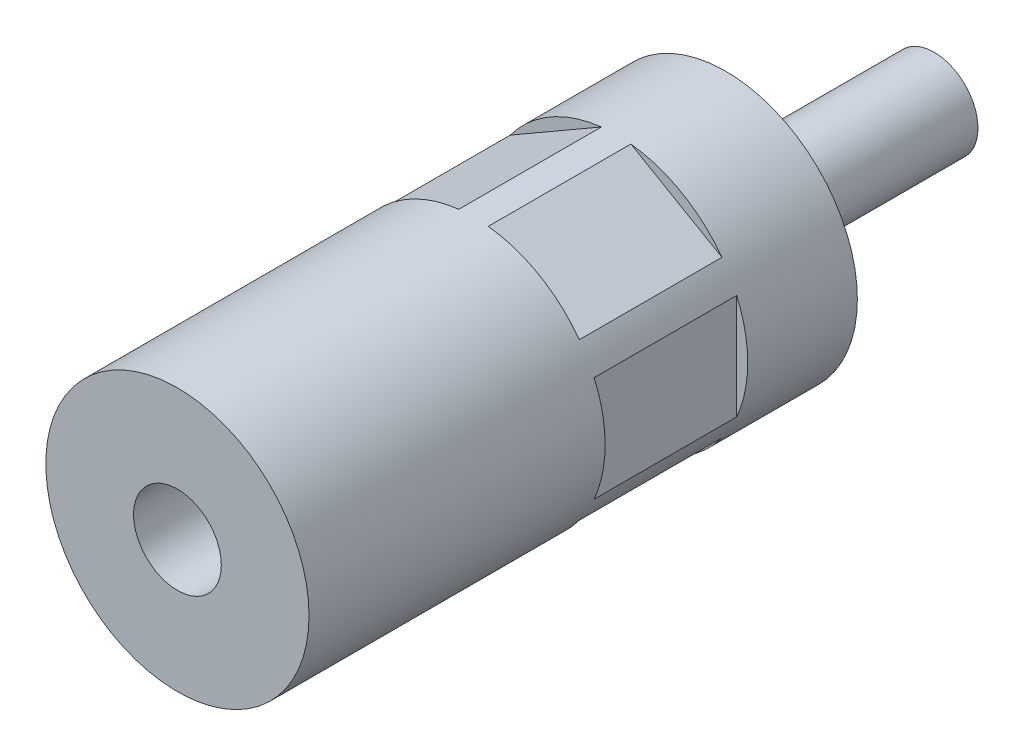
ISO-10303-21;
HEADER;
FILE_DESCRIPTION(('STEP AP214'),'2;1');
FILE_NAME('part.step','',(''),(''),'','','');
FILE_SCHEMA(('AUTOMOTIVE_DESIGN { 1 0 10303 214 1 1 1 1 }'));
ENDSEC;
DATA;
#1=APPLICATION_CONTEXT('core data for automotive mechanical design processes');
#2=APPLICATION_PROTOCOL_DEFINITION('international standard','automotive_design',2000,#1);
#3=PRODUCT_CONTEXT('',#1,'mechanical');
#4=PRODUCT('Part','Part','',(#3));
#5=PRODUCT_RELATED_PRODUCT_CATEGORY('part','',(#4));
#6=PRODUCT_DEFINITION_FORMATION('','',#4);
#7=PRODUCT_DEFINITION_CONTEXT('part definition',#1,'design');
#8=PRODUCT_DEFINITION('design','',#6,#7);
#9=PRODUCT_DEFINITION_SHAPE('','',#8);
#10=(LENGTH_UNIT() NAMED_UNIT(*) SI_UNIT(.MILLI.,.METRE.));
#11=(NAMED_UNIT(*) PLANE_ANGLE_UNIT() SI_UNIT($,.RADIAN.));
#12=(NAMED_UNIT(*) SI_UNIT($,.STERADIAN.) SOLID_ANGLE_UNIT());
#13=UNCERTAINTY_MEASURE_WITH_UNIT(LENGTH_MEASURE(1.E-05),#10,'distance_accuracy_value','');
#14=(GEOMETRIC_REPRESENTATION_CONTEXT(3) GLOBAL_UNCERTAINTY_ASSIGNED_CONTEXT((#13)) GLOBAL_UNIT_ASSIGNED_CONTEXT((#10,
#11,#12)) REPRESENTATION_CONTEXT('',''));
#15=CARTESIAN_POINT('',(0.,0.,0.));
#16=DIRECTION('',(0.,0.,1.));
#17=DIRECTION('',(1.,0.,0.));
#18=AXIS2_PLACEMENT_3D('',#15,#16,#17);
#19=CARTESIAN_POINT('',(0.,0.,80.));
#20=DIRECTION('',(0.,0.,1.));
#21=DIRECTION('',(1.,0.,0.));
#22=AXIS2_PLACEMENT_3D('',#19,#20,#21);
#23=CYLINDRICAL_SURFACE('',#22,12.);
#24=CARTESIAN_POINT('',(0.,0.,10.));
#25=DIRECTION('',(0.,0.,1.));
#26=DIRECTION('',(1.,0.,0.));
#27=AXIS2_PLACEMENT_3D('',#24,#25,#26);
#28=CIRCLE('',#27,12.);
#29=CARTESIAN_POINT('',(-9.653311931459,-7.12836367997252,10.));
#30=VERTEX_POINT('',#29);
#31=CARTESIAN_POINT('',(-1.34668806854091,-11.9241952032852,10.));
#32=VERTEX_POINT('',#31);
#33=EDGE_CURVE('E152',#30,#32,#28,.T.);
#34=ORIENTED_EDGE('',*,*,#33,.F.);
#35=DIRECTION('',(0.,0.,1.));
#36=VECTOR('',#35,1.);
#37=CARTESIAN_POINT('',(-9.65331193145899,-7.12836367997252,80.));
#38=LINE('',#37,#36);
#39=CARTESIAN_POINT('',(-9.653311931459,-7.12836367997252,23.));
#40=VERTEX_POINT('',#39);
#41=EDGE_CURVE('E9',#30,#40,#38,.T.);
#42=ORIENTED_EDGE('',*,*,#41,.T.);
#43=CARTESIAN_POINT('',(0.,0.,23.));
#44=DIRECTION('',(0.,0.,1.));
#45=DIRECTION('',(1.,0.,0.));
#46=AXIS2_PLACEMENT_3D('',#43,#44,#45);
#47=CIRCLE('',#46,12.);
#48=CARTESIAN_POINT('',(-1.34668806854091,-11.9241952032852,23.));
#49=VERTEX_POINT('',#48);
#50=EDGE_CURVE('E22',#40,#49,#47,.T.);
#51=ORIENTED_EDGE('',*,*,#50,.T.);
#52=DIRECTION('',(0.,0.,1.));
#53=VECTOR('',#52,1.);
#54=CARTESIAN_POINT('',(-1.34668806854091,-11.9241952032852,80.));
#55=LINE('',#54,#53);
#56=EDGE_CURVE('E149',#49,#32,#55,.F.);
#57=ORIENTED_EDGE('',*,*,#56,.T.);
#58=EDGE_LOOP('',(#34,#42,#51,#57));
#59=FACE_BOUND('',#58,.T.);
#60=DIRECTION('',(0.,0.,1.));
#61=VECTOR('',#60,1.);
#62=CARTESIAN_POINT('',(11.,4.79583152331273,80.));
#63=LINE('',#62,#61);
#64=CARTESIAN_POINT('',(11.,4.79583152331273,10.));
#65=VERTEX_POINT('',#64);
#66=CARTESIAN_POINT('',(11.,4.79583152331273,23.));
#67=VERTEX_POINT('',#66);
#68=EDGE_CURVE('E142',#65,#67,#63,.T.);
#69=ORIENTED_EDGE('',*,*,#68,.F.);
#70=CARTESIAN_POINT('',(11.,-4.79583152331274,10.));
#71=VERTEX_POINT('',#70);
#72=EDGE_CURVE('E141',#71,#65,#28,.T.);
#73=ORIENTED_EDGE('',*,*,#72,.F.);
#74=DIRECTION('',(0.,0.,1.));
#75=VECTOR('',#74,1.);
#76=CARTESIAN_POINT('',(11.,-4.79583152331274,80.));
#77=LINE('',#76,#75);
#78=CARTESIAN_POINT('',(11.,-4.79583152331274,23.));
#79=VERTEX_POINT('',#78);
#80=EDGE_CURVE('E138',#79,#71,#77,.F.);
#81=ORIENTED_EDGE('',*,*,#80,.F.);
#82=EDGE_CURVE('E145',#79,#67,#47,.T.);
#83=ORIENTED_EDGE('',*,*,#82,.T.);
#84=EDGE_LOOP('',(#69,#73,#81,#83));
#85=FACE_BOUND('',#84,.T.);
#86=CARTESIAN_POINT('',(9.65331193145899,7.12836367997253,10.));
#87=VERTEX_POINT('',#86);
#88=CARTESIAN_POINT('',(1.34668806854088,11.9241952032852,10.));
#89=VERTEX_POINT('',#88);
#90=EDGE_CURVE('E134',#87,#89,#28,.T.);
#91=ORIENTED_EDGE('',*,*,#90,.F.);
#92=DIRECTION('',(0.,0.,1.));
#93=VECTOR('',#92,1.);
#94=CARTESIAN_POINT('',(9.65331193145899,7.12836367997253,80.));
#95=LINE('',#94,#93);
#96=CARTESIAN_POINT('',(9.65331193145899,7.12836367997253,23.));
#97=VERTEX_POINT('',#96);
#98=EDGE_CURVE('E135',#87,#97,#95,.T.);
#99=ORIENTED_EDGE('',*,*,#98,.T.);
#100=CARTESIAN_POINT('',(1.34668806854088,11.9241952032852,23.));
#101=VERTEX_POINT('',#100);
#102=EDGE_CURVE('E139',#97,#101,#47,.T.);
#103=ORIENTED_EDGE('',*,*,#102,.T.);
#104=DIRECTION('',(0.,0.,1.));
#105=VECTOR('',#104,1.);
#106=CARTESIAN_POINT('',(1.34668806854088,11.9241952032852,80.));
#107=LINE('',#106,#105);
#108=EDGE_CURVE('E131',#101,#89,#107,.F.);
#109=ORIENTED_EDGE('',*,*,#108,.T.);
#110=EDGE_LOOP('',(#91,#99,#103,#109));
#111=FACE_BOUND('',#110,.T.);
#112=CARTESIAN_POINT('',(0.,0.,0.));
#113=DIRECTION('',(0.,0.,1.));
#114=DIRECTION('',(1.,0.,0.));
#115=AXIS2_PLACEMENT_3D('',#112,#113,#114);
#116=CIRCLE('',#115,12.);
#117=CARTESIAN_POINT('',(12.,0.,0.));
#118=VERTEX_POINT('',#117);
#119=EDGE_CURVE('E204',#118,#118,#116,.T.);
#120=ORIENTED_EDGE('',*,*,#119,.T.);
#121=EDGE_LOOP('',(#120));
#122=FACE_BOUND('',#121,.T.);
#123=CARTESIAN_POINT('',(0.,0.,50.));
#124=DIRECTION('',(0.,0.,1.));
#125=DIRECTION('',(1.,0.,0.));
#126=AXIS2_PLACEMENT_3D('',#123,#124,#125);
#127=CIRCLE('',#126,12.);
#128=CARTESIAN_POINT('',(12.,0.,50.));
#129=VERTEX_POINT('',#128);
#130=EDGE_CURVE('E201',#129,#129,#127,.T.);
#131=ORIENTED_EDGE('',*,*,#130,.F.);
#132=EDGE_LOOP('',(#131));
#133=FACE_BOUND('',#132,.T.);
#134=CARTESIAN_POINT('',(-11.,4.79583152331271,10.));
#135=VERTEX_POINT('',#134);
#136=CARTESIAN_POINT('',(-11.,-4.79583152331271,10.));
#137=VERTEX_POINT('',#136);
#138=EDGE_CURVE('E111',#135,#137,#28,.T.);
#139=ORIENTED_EDGE('',*,*,#138,.F.);
#140=DIRECTION('',(0.,0.,1.));
#141=VECTOR('',#140,1.);
#142=CARTESIAN_POINT('',(-11.,4.79583152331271,80.));
#143=LINE('',#142,#141);
#144=CARTESIAN_POINT('',(-11.,4.79583152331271,23.));
#145=VERTEX_POINT('',#144);
#146=EDGE_CURVE('E110',#135,#145,#143,.T.);
#147=ORIENTED_EDGE('',*,*,#146,.T.);
#148=CARTESIAN_POINT('',(-11.,-4.79583152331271,23.));
#149=VERTEX_POINT('',#148);
#150=EDGE_CURVE('E103',#145,#149,#47,.T.);
#151=ORIENTED_EDGE('',*,*,#150,.T.);
#152=DIRECTION('',(0.,0.,1.));
#153=VECTOR('',#152,1.);
#154=CARTESIAN_POINT('',(-11.,-4.79583152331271,80.));
#155=LINE('',#154,#153);
#156=EDGE_CURVE('E117',#149,#137,#155,.F.);
#157=ORIENTED_EDGE('',*,*,#156,.T.);
#158=EDGE_LOOP('',(#139,#147,#151,#157));
#159=FACE_BOUND('',#158,.T.);
#160=DIRECTION('',(0.,0.,1.));
#161=VECTOR('',#160,1.);
#162=CARTESIAN_POINT('',(-9.65331193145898,7.12836367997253,80.));
#163=LINE('',#162,#161);
#164=CARTESIAN_POINT('',(-9.65331193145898,7.12836367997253,10.));
#165=VERTEX_POINT('',#164);
#166=CARTESIAN_POINT('',(-9.65331193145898,7.12836367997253,23.));
#167=VERTEX_POINT('',#166);
#168=EDGE_CURVE('E129',#165,#167,#163,.T.);
#169=ORIENTED_EDGE('',*,*,#168,.F.);
#170=CARTESIAN_POINT('',(-1.3466880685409,11.9241952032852,10.));
#171=VERTEX_POINT('',#170);
#172=EDGE_CURVE('E125',#171,#165,#28,.T.);
#173=ORIENTED_EDGE('',*,*,#172,.F.);
#174=DIRECTION('',(0.,0.,1.));
#175=VECTOR('',#174,1.);
#176=CARTESIAN_POINT('',(-1.3466880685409,11.9241952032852,80.));
#177=LINE('',#176,#175);
#178=CARTESIAN_POINT('',(-1.3466880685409,11.9241952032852,23.));
#179=VERTEX_POINT('',#178);
#180=EDGE_CURVE('E123',#179,#171,#177,.F.);
#181=ORIENTED_EDGE('',*,*,#180,.F.);
#182=EDGE_CURVE('E113',#179,#167,#47,.T.);
#183=ORIENTED_EDGE('',*,*,#182,.T.);
#184=EDGE_LOOP('',(#169,#173,#181,#183));
#185=FACE_BOUND('',#184,.T.);
#186=DIRECTION('',(0.,0.,1.));
#187=VECTOR('',#186,1.);
#188=CARTESIAN_POINT('',(9.65331193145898,-7.12836367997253,80.));
#189=LINE('',#188,#187);
#190=CARTESIAN_POINT('',(9.65331193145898,-7.12836367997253,10.));
#191=VERTEX_POINT('',#190);
#192=CARTESIAN_POINT('',(9.65331193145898,-7.12836367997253,23.));
#193=VERTEX_POINT('',#192);
#194=EDGE_CURVE('E148',#191,#193,#189,.T.);
#195=ORIENTED_EDGE('',*,*,#194,.F.);
#196=CARTESIAN_POINT('',(1.34668806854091,-11.9241952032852,10.));
#197=VERTEX_POINT('',#196);
#198=EDGE_CURVE('E147',#197,#191,#28,.T.);
#199=ORIENTED_EDGE('',*,*,#198,.F.);
#200=DIRECTION('',(0.,0.,1.));
#201=VECTOR('',#200,1.);
#202=CARTESIAN_POINT('',(1.34668806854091,-11.9241952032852,80.));
#203=LINE('',#202,#201);
#204=CARTESIAN_POINT('',(1.34668806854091,-11.9241952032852,23.));
#205=VERTEX_POINT('',#204);
#206=EDGE_CURVE('E144',#205,#197,#203,.F.);
#207=ORIENTED_EDGE('',*,*,#206,.F.);
#208=EDGE_CURVE('E150',#205,#193,#47,.T.);
#209=ORIENTED_EDGE('',*,*,#208,.T.);
#210=EDGE_LOOP('',(#195,#199,#207,#209));
#211=FACE_BOUND('',#210,.T.);
#212=ADVANCED_FACE('F14',(#59,#85,#111,#122,#133,#159,#185,#211),#23,.T.);
#213=CARTESIAN_POINT('',(0.,0.,-19.));
#214=DIRECTION('',(0.,0.,1.));
#215=DIRECTION('',(1.,0.,0.));
#216=AXIS2_PLACEMENT_3D('',#213,#214,#215);
#217=PLANE('',#216);
#218=CARTESIAN_POINT('',(0.,0.,-19.));
#219=DIRECTION('',(0.,0.,1.));
#220=DIRECTION('',(1.,0.,0.));
#221=AXIS2_PLACEMENT_3D('',#218,#219,#220);
#222=CIRCLE('',#221,4.);
#223=CARTESIAN_POINT('',(4.,0.,-19.));
#224=VERTEX_POINT('',#223);
#225=EDGE_CURVE('E159',#224,#224,#222,.T.);
#226=ORIENTED_EDGE('',*,*,#225,.F.);
#227=EDGE_LOOP('',(#226));
#228=FACE_BOUND('',#227,.T.);
#229=ADVANCED_FACE('F16',(#228),#217,.F.);
#230=CARTESIAN_POINT('',(0.,0.,80.));
#231=DIRECTION('',(0.,0.,1.));
#232=DIRECTION('',(1.,0.,0.));
#233=AXIS2_PLACEMENT_3D('',#230,#231,#232);
#234=CYLINDRICAL_SURFACE('',#233,4.);
#235=CARTESIAN_POINT('',(0.,0.,-2.5));
#236=DIRECTION('',(0.,0.,1.));
#237=DIRECTION('',(1.,0.,0.));
#238=AXIS2_PLACEMENT_3D('',#235,#236,#237);
#239=CIRCLE('',#238,4.);
#240=CARTESIAN_POINT('',(4.,0.,-2.5));
#241=VERTEX_POINT('',#240);
#242=EDGE_CURVE('E213',#241,#241,#239,.T.);
#243=ORIENTED_EDGE('',*,*,#242,.F.);
#244=EDGE_LOOP('',(#243));
#245=FACE_BOUND('',#244,.T.);
#246=ORIENTED_EDGE('',*,*,#225,.T.);
#247=EDGE_LOOP('',(#246));
#248=FACE_BOUND('',#247,.T.);
#249=ADVANCED_FACE('F219',(#245,#248),#234,.T.);
#250=CARTESIAN_POINT('',(3.25,0.,-2.5));
#251=DIRECTION('',(0.,0.,1.));
#252=DIRECTION('',(1.,0.,0.));
#253=AXIS2_PLACEMENT_3D('',#250,#251,#252);
#254=PLANE('',#253);
#255=ORIENTED_EDGE('',*,*,#242,.T.);
#256=EDGE_LOOP('',(#255));
#257=FACE_BOUND('',#256,.T.);
#258=CARTESIAN_POINT('',(0.,0.,-2.5));
#259=DIRECTION('',(0.,0.,1.));
#260=DIRECTION('',(1.,0.,0.));
#261=AXIS2_PLACEMENT_3D('',#258,#259,#260);
#262=CIRCLE('',#261,3.25);
#263=CARTESIAN_POINT('',(3.25,0.,-2.5));
#264=VERTEX_POINT('',#263);
#265=EDGE_CURVE('E210',#264,#264,#262,.T.);
#266=ORIENTED_EDGE('',*,*,#265,.F.);
#267=EDGE_LOOP('',(#266));
#268=FACE_BOUND('',#267,.T.);
#269=ADVANCED_FACE('F228',(#257,#268),#254,.T.);
#270=CARTESIAN_POINT('',(0.,0.,80.));
#271=DIRECTION('',(0.,0.,1.));
#272=DIRECTION('',(1.,0.,0.));
#273=AXIS2_PLACEMENT_3D('',#270,#271,#272);
#274=CYLINDRICAL_SURFACE('',#273,3.25);
#275=ORIENTED_EDGE('',*,*,#265,.T.);
#276=EDGE_LOOP('',(#275));
#277=FACE_BOUND('',#276,.T.);
#278=CARTESIAN_POINT('',(0.,0.,0.));
#279=DIRECTION('',(0.,0.,1.));
#280=DIRECTION('',(1.,0.,0.));
#281=AXIS2_PLACEMENT_3D('',#278,#279,#280);
#282=CIRCLE('',#281,3.25);
#283=CARTESIAN_POINT('',(3.25,0.,0.));
#284=VERTEX_POINT('',#283);
#285=EDGE_CURVE('E207',#284,#284,#282,.T.);
#286=ORIENTED_EDGE('',*,*,#285,.F.);
#287=EDGE_LOOP('',(#286));
#288=FACE_BOUND('',#287,.T.);
#289=ADVANCED_FACE('F241',(#277,#288),#274,.T.);
#290=CARTESIAN_POINT('',(12.,0.,0.));
#291=DIRECTION('',(0.,0.,-1.));
#292=DIRECTION('',(-1.,0.,0.));
#293=AXIS2_PLACEMENT_3D('',#290,#291,#292);
#294=PLANE('',#293);
#295=ORIENTED_EDGE('',*,*,#285,.T.);
#296=EDGE_LOOP('',(#295));
#297=FACE_BOUND('',#296,.T.);
#298=ORIENTED_EDGE('',*,*,#119,.F.);
#299=EDGE_LOOP('',(#298));
#300=FACE_BOUND('',#299,.T.);
#301=ADVANCED_FACE('F238',(#297,#300),#294,.T.);
#302=CARTESIAN_POINT('',(12.,0.,50.));
#303=DIRECTION('',(0.,0.,-1.));
#304=DIRECTION('',(-1.,0.,0.));
#305=AXIS2_PLACEMENT_3D('',#302,#303,#304);
#306=PLANE('',#305);
#307=CARTESIAN_POINT('',(0.,0.,50.));
#308=DIRECTION('',(0.,0.,1.));
#309=DIRECTION('',(1.,0.,0.));
#310=AXIS2_PLACEMENT_3D('',#307,#308,#309);
#311=CIRCLE('',#310,4.);
#312=CARTESIAN_POINT('',(4.,0.,50.));
#313=VERTEX_POINT('',#312);
#314=EDGE_CURVE('E190',#313,#313,#311,.T.);
#315=ORIENTED_EDGE('',*,*,#314,.F.);
#316=EDGE_LOOP('',(#315));
#317=FACE_BOUND('',#316,.T.);
#318=ORIENTED_EDGE('',*,*,#130,.T.);
#319=EDGE_LOOP('',(#318));
#320=FACE_BOUND('',#319,.T.);
#321=ADVANCED_FACE('F236',(#317,#320),#306,.F.);
#322=CARTESIAN_POINT('',(0.,0.,80.));
#323=DIRECTION('',(0.,0.,1.));
#324=DIRECTION('',(1.,0.,0.));
#325=AXIS2_PLACEMENT_3D('',#322,#323,#324);
#326=CYLINDRICAL_SURFACE('',#325,4.);
#327=CARTESIAN_POINT('',(0.,0.,30.));
#328=DIRECTION('',(0.,0.,1.));
#329=DIRECTION('',(1.,0.,0.));
#330=AXIS2_PLACEMENT_3D('',#327,#328,#329);
#331=CIRCLE('',#330,4.);
#332=CARTESIAN_POINT('',(4.,0.,30.));
#333=VERTEX_POINT('',#332);
#334=EDGE_CURVE('E318',#333,#333,#331,.T.);
#335=ORIENTED_EDGE('',*,*,#334,.F.);
#336=EDGE_LOOP('',(#335));
#337=FACE_BOUND('',#336,.T.);
#338=ORIENTED_EDGE('',*,*,#314,.T.);
#339=EDGE_LOOP('',(#338));
#340=FACE_BOUND('',#339,.T.);
#341=ADVANCED_FACE('F263',(#337,#340),#326,.F.);
#342=CARTESIAN_POINT('',(-11.,6.35085296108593,23.));
#343=DIRECTION('',(1.,0.,0.));
#344=DIRECTION('',(0.,0.,-1.));
#345=AXIS2_PLACEMENT_3D('',#342,#343,#344);
#346=PLANE('',#345);
#347=DIRECTION('',(0.,-1.,0.));
#348=VECTOR('',#347,1.);
#349=CARTESIAN_POINT('',(-11.,6.35085296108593,10.));
#350=LINE('',#349,#348);
#351=EDGE_CURVE('E319',#135,#137,#350,.T.);
#352=ORIENTED_EDGE('',*,*,#351,.T.);
#353=ORIENTED_EDGE('',*,*,#156,.F.);
#354=DIRECTION('',(0.,-1.,0.));
#355=VECTOR('',#354,1.);
#356=CARTESIAN_POINT('',(-11.,6.35085296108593,23.));
#357=LINE('',#356,#355);
#358=EDGE_CURVE('E106',#145,#149,#357,.T.);
#359=ORIENTED_EDGE('',*,*,#358,.F.);
#360=ORIENTED_EDGE('',*,*,#146,.F.);
#361=EDGE_LOOP('',(#352,#353,#359,#360));
#362=FACE_BOUND('',#361,.T.);
#363=ADVANCED_FACE('F115',(#362),#346,.F.);
#364=CARTESIAN_POINT('',(0.,0.,10.));
#365=DIRECTION('',(0.,0.,1.));
#366=DIRECTION('',(1.,0.,0.));
#367=AXIS2_PLACEMENT_3D('',#364,#365,#366);
#368=PLANE('',#367);
#369=ORIENTED_EDGE('',*,*,#138,.T.);
#370=ORIENTED_EDGE('',*,*,#351,.F.);
#371=EDGE_LOOP('',(#369,#370));
#372=FACE_BOUND('',#371,.T.);
#373=ADVANCED_FACE('F276',(#372),#368,.T.);
#374=CARTESIAN_POINT('',(0.,0.,23.));
#375=DIRECTION('',(0.,0.,1.));
#376=DIRECTION('',(1.,0.,0.));
#377=AXIS2_PLACEMENT_3D('',#374,#375,#376);
#378=PLANE('',#377);
#379=ORIENTED_EDGE('',*,*,#358,.T.);
#380=ORIENTED_EDGE('',*,*,#150,.F.);
#381=EDGE_LOOP('',(#379,#380));
#382=FACE_BOUND('',#381,.T.);
#383=ADVANCED_FACE('F105',(#382),#378,.F.);
#384=CARTESIAN_POINT('',(-11.,6.35085296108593,23.));
#385=DIRECTION('',(-0.5,0.866025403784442,0.));
#386=DIRECTION('',(-0.866025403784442,-0.5,0.));
#387=AXIS2_PLACEMENT_3D('',#384,#385,#386);
#388=PLANE('',#387);
#389=ORIENTED_EDGE('',*,*,#168,.T.);
#390=DIRECTION('',(0.866025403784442,0.5,0.));
#391=VECTOR('',#390,1.);
#392=CARTESIAN_POINT('',(-11.,6.35085296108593,23.));
#393=LINE('',#392,#391);
#394=EDGE_CURVE('E118',#167,#179,#393,.T.);
#395=ORIENTED_EDGE('',*,*,#394,.T.);
#396=ORIENTED_EDGE('',*,*,#180,.T.);
#397=DIRECTION('',(0.866025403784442,0.5,0.));
#398=VECTOR('',#397,1.);
#399=CARTESIAN_POINT('',(-11.,6.35085296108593,10.));
#400=LINE('',#399,#398);
#401=EDGE_CURVE('E321',#165,#171,#400,.T.);
#402=ORIENTED_EDGE('',*,*,#401,.F.);
#403=EDGE_LOOP('',(#389,#395,#396,#402));
#404=FACE_BOUND('',#403,.T.);
#405=ADVANCED_FACE('F303',(#404),#388,.T.);
#406=ORIENTED_EDGE('',*,*,#172,.T.);
#407=ORIENTED_EDGE('',*,*,#401,.T.);
#408=EDGE_LOOP('',(#406,#407));
#409=FACE_BOUND('',#408,.T.);
#410=ADVANCED_FACE('F291',(#409),#368,.T.);
#411=ORIENTED_EDGE('',*,*,#394,.F.);
#412=ORIENTED_EDGE('',*,*,#182,.F.);
#413=EDGE_LOOP('',(#411,#412));
#414=FACE_BOUND('',#413,.T.);
#415=ADVANCED_FACE('F286',(#414),#378,.F.);
#416=CARTESIAN_POINT('',(11.,6.35085296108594,23.));
#417=DIRECTION('',(-0.499999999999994,-0.866025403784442,0.));
#418=DIRECTION('',(0.866025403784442,-0.499999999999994,0.));
#419=AXIS2_PLACEMENT_3D('',#416,#417,#418);
#420=PLANE('',#419);
#421=DIRECTION('',(-0.866025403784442,0.499999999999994,0.));
#422=VECTOR('',#421,1.);
#423=CARTESIAN_POINT('',(11.,6.35085296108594,10.));
#424=LINE('',#423,#422);
#425=EDGE_CURVE('E329',#87,#89,#424,.T.);
#426=ORIENTED_EDGE('',*,*,#425,.T.);
#427=ORIENTED_EDGE('',*,*,#108,.F.);
#428=DIRECTION('',(-0.866025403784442,0.499999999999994,0.));
#429=VECTOR('',#428,1.);
#430=CARTESIAN_POINT('',(11.,6.35085296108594,23.));
#431=LINE('',#430,#429);
#432=EDGE_CURVE('E192',#97,#101,#431,.T.);
#433=ORIENTED_EDGE('',*,*,#432,.F.);
#434=ORIENTED_EDGE('',*,*,#98,.F.);
#435=EDGE_LOOP('',(#426,#427,#433,#434));
#436=FACE_BOUND('',#435,.T.);
#437=ADVANCED_FACE('F290',(#436),#420,.F.);
#438=ORIENTED_EDGE('',*,*,#90,.T.);
#439=ORIENTED_EDGE('',*,*,#425,.F.);
#440=EDGE_LOOP('',(#438,#439));
#441=FACE_BOUND('',#440,.T.);
#442=ADVANCED_FACE('F284',(#441),#368,.T.);
#443=ORIENTED_EDGE('',*,*,#432,.T.);
#444=ORIENTED_EDGE('',*,*,#102,.F.);
#445=EDGE_LOOP('',(#443,#444));
#446=FACE_BOUND('',#445,.T.);
#447=ADVANCED_FACE('F280',(#446),#378,.F.);
#448=CARTESIAN_POINT('',(11.,6.35085296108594,23.));
#449=DIRECTION('',(1.,0.,0.));
#450=DIRECTION('',(0.,1.,0.));
#451=AXIS2_PLACEMENT_3D('',#448,#449,#450);
#452=PLANE('',#451);
#453=ORIENTED_EDGE('',*,*,#68,.T.);
#454=DIRECTION('',(0.,-1.,0.));
#455=VECTOR('',#454,1.);
#456=CARTESIAN_POINT('',(11.,6.35085296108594,23.));
#457=LINE('',#456,#455);
#458=EDGE_CURVE('E187',#67,#79,#457,.T.);
#459=ORIENTED_EDGE('',*,*,#458,.T.);
#460=ORIENTED_EDGE('',*,*,#80,.T.);
#461=DIRECTION('',(0.,-1.,0.));
#462=VECTOR('',#461,1.);
#463=CARTESIAN_POINT('',(11.,6.35085296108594,10.));
#464=LINE('',#463,#462);
#465=EDGE_CURVE('E328',#65,#71,#464,.T.);
#466=ORIENTED_EDGE('',*,*,#465,.F.);
#467=EDGE_LOOP('',(#453,#459,#460,#466));
#468=FACE_BOUND('',#467,.T.);
#469=ADVANCED_FACE('F283',(#468),#452,.T.);
#470=ORIENTED_EDGE('',*,*,#72,.T.);
#471=ORIENTED_EDGE('',*,*,#465,.T.);
#472=EDGE_LOOP('',(#470,#471));
#473=FACE_BOUND('',#472,.T.);
#474=ADVANCED_FACE('F292',(#473),#368,.T.);
#475=ORIENTED_EDGE('',*,*,#458,.F.);
#476=ORIENTED_EDGE('',*,*,#82,.F.);
#477=EDGE_LOOP('',(#475,#476));
#478=FACE_BOUND('',#477,.T.);
#479=ADVANCED_FACE('F287',(#478),#378,.F.);
#480=CARTESIAN_POINT('',(11.,-6.35085296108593,23.));
#481=DIRECTION('',(0.5,-0.866025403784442,0.));
#482=DIRECTION('',(0.866025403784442,0.5,0.));
#483=AXIS2_PLACEMENT_3D('',#480,#481,#482);
#484=PLANE('',#483);
#485=ORIENTED_EDGE('',*,*,#194,.T.);
#486=DIRECTION('',(-0.866025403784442,-0.5,0.));
#487=VECTOR('',#486,1.);
#488=CARTESIAN_POINT('',(11.,-6.35085296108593,23.));
#489=LINE('',#488,#487);
#490=EDGE_CURVE('E37',#193,#205,#489,.T.);
#491=ORIENTED_EDGE('',*,*,#490,.T.);
#492=ORIENTED_EDGE('',*,*,#206,.T.);
#493=DIRECTION('',(-0.866025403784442,-0.5,0.));
#494=VECTOR('',#493,1.);
#495=CARTESIAN_POINT('',(11.,-6.35085296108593,10.));
#496=LINE('',#495,#494);
#497=EDGE_CURVE('E325',#191,#197,#496,.T.);
#498=ORIENTED_EDGE('',*,*,#497,.F.);
#499=EDGE_LOOP('',(#485,#491,#492,#498));
#500=FACE_BOUND('',#499,.T.);
#501=ADVANCED_FACE('F293',(#500),#484,.T.);
#502=ORIENTED_EDGE('',*,*,#198,.T.);
#503=ORIENTED_EDGE('',*,*,#497,.T.);
#504=EDGE_LOOP('',(#502,#503));
#505=FACE_BOUND('',#504,.T.);
#506=ADVANCED_FACE('F296',(#505),#368,.T.);
#507=ORIENTED_EDGE('',*,*,#490,.F.);
#508=ORIENTED_EDGE('',*,*,#208,.F.);
#509=EDGE_LOOP('',(#507,#508));
#510=FACE_BOUND('',#509,.T.);
#511=ADVANCED_FACE('F185',(#510),#378,.F.);
#512=DIRECTION('',(0.866025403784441,-0.5,0.));
#513=VECTOR('',#512,1.);
#514=CARTESIAN_POINT('',(-11.,-6.35085296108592,23.));
#515=LINE('',#514,#513);
#516=EDGE_CURVE('E186',#40,#49,#515,.T.);
#517=ORIENTED_EDGE('',*,*,#516,.T.);
#518=ORIENTED_EDGE('',*,*,#50,.F.);
#519=EDGE_LOOP('',(#517,#518));
#520=FACE_BOUND('',#519,.T.);
#521=ADVANCED_FACE('F342',(#520),#378,.F.);
#522=ORIENTED_EDGE('',*,*,#33,.T.);
#523=DIRECTION('',(0.866025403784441,-0.5,0.));
#524=VECTOR('',#523,1.);
#525=CARTESIAN_POINT('',(-11.,-6.35085296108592,10.));
#526=LINE('',#525,#524);
#527=EDGE_CURVE('E29',#30,#32,#526,.T.);
#528=ORIENTED_EDGE('',*,*,#527,.F.);
#529=EDGE_LOOP('',(#522,#528));
#530=FACE_BOUND('',#529,.T.);
#531=ADVANCED_FACE('F311',(#530),#368,.T.);
#532=CARTESIAN_POINT('',(-11.,-6.35085296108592,23.));
#533=DIRECTION('',(0.5,0.866025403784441,0.));
#534=DIRECTION('',(-0.866025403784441,0.5,0.));
#535=AXIS2_PLACEMENT_3D('',#532,#533,#534);
#536=PLANE('',#535);
#537=ORIENTED_EDGE('',*,*,#527,.T.);
#538=ORIENTED_EDGE('',*,*,#56,.F.);
#539=ORIENTED_EDGE('',*,*,#516,.F.);
#540=ORIENTED_EDGE('',*,*,#41,.F.);
#541=EDGE_LOOP('',(#537,#538,#539,#540));
#542=FACE_BOUND('',#541,.T.);
#543=ADVANCED_FACE('F307',(#542),#536,.F.);
#544=CARTESIAN_POINT('',(0.,0.,30.));
#545=DIRECTION('',(0.,0.,1.));
#546=DIRECTION('',(1.,0.,0.));
#547=AXIS2_PLACEMENT_3D('',#544,#545,#546);
#548=PLANE('',#547);
#549=ORIENTED_EDGE('',*,*,#334,.T.);
#550=EDGE_LOOP('',(#549));
#551=FACE_BOUND('',#550,.T.);
#552=ADVANCED_FACE('F310',(#551),#548,.T.);
#553=CLOSED_SHELL('',(#212,#229,#249,#269,#289,#301,#321,#341,#363,#373,#383,#405,#410,#415,
#437,#442,#447,#469,#474,#479,#501,#506,#511,#521,#531,#543,#552));
#554=MANIFOLD_SOLID_BREP('B1',#553);
#555=ADVANCED_BREP_SHAPE_REPRESENTATION('',(#18,#554),#14);
#556=SHAPE_DEFINITION_REPRESENTATION(#9,#555);
ENDSEC;
END-ISO-10303-21;
